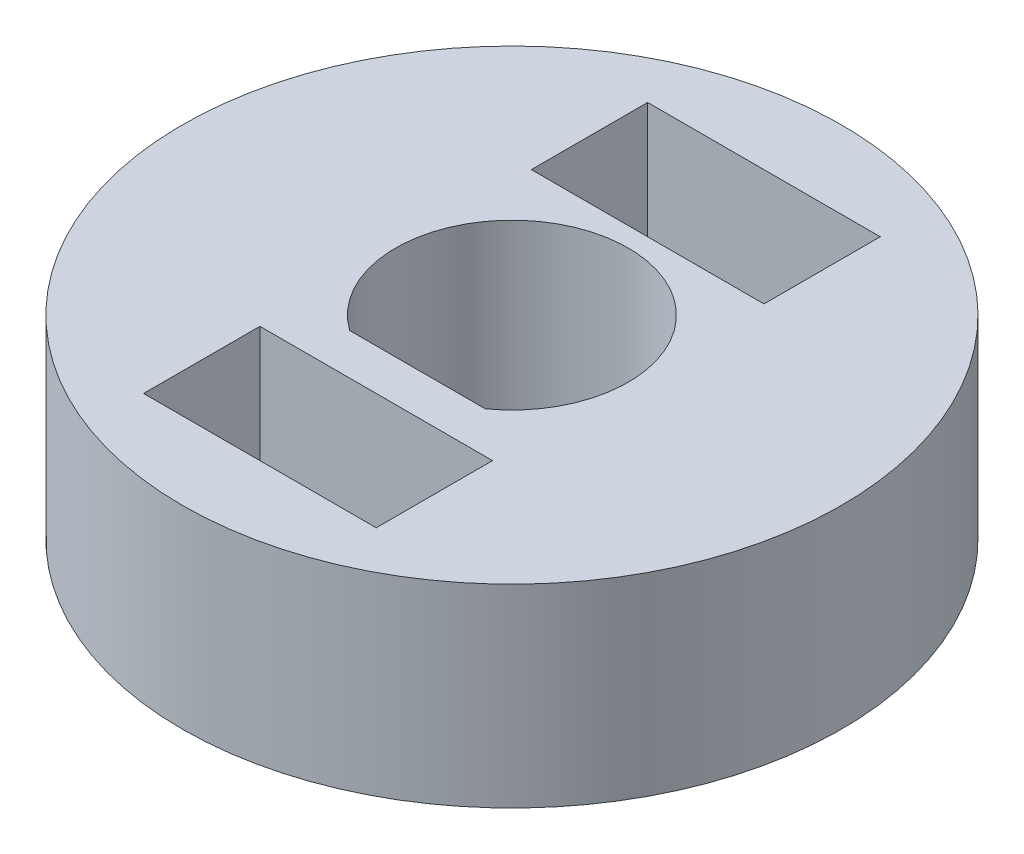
ISO-10303-21;
HEADER;
FILE_DESCRIPTION(('STEP AP214'),'2;1');
FILE_NAME('part.step','',(''),(''),'','','');
FILE_SCHEMA(('AUTOMOTIVE_DESIGN { 1 0 10303 214 1 1 1 1 }'));
ENDSEC;
DATA;
#1=APPLICATION_CONTEXT('core data for automotive mechanical design processes');
#2=APPLICATION_PROTOCOL_DEFINITION('international standard','automotive_design',2000,#1);
#3=PRODUCT_CONTEXT('',#1,'mechanical');
#4=PRODUCT('Part','Part','',(#3));
#5=PRODUCT_RELATED_PRODUCT_CATEGORY('part','',(#4));
#6=PRODUCT_DEFINITION_FORMATION('','',#4);
#7=PRODUCT_DEFINITION_CONTEXT('part definition',#1,'design');
#8=PRODUCT_DEFINITION('design','',#6,#7);
#9=PRODUCT_DEFINITION_SHAPE('','',#8);
#10=(LENGTH_UNIT() NAMED_UNIT(*) SI_UNIT(.MILLI.,.METRE.));
#11=(NAMED_UNIT(*) PLANE_ANGLE_UNIT() SI_UNIT($,.RADIAN.));
#12=(NAMED_UNIT(*) SI_UNIT($,.STERADIAN.) SOLID_ANGLE_UNIT());
#13=UNCERTAINTY_MEASURE_WITH_UNIT(LENGTH_MEASURE(1.E-05),#10,'distance_accuracy_value','');
#14=(GEOMETRIC_REPRESENTATION_CONTEXT(3) GLOBAL_UNCERTAINTY_ASSIGNED_CONTEXT((#13)) GLOBAL_UNIT_ASSIGNED_CONTEXT((#10,
#11,#12)) REPRESENTATION_CONTEXT('',''));
#15=CARTESIAN_POINT('',(0.,0.,0.));
#16=DIRECTION('',(0.,0.,1.));
#17=DIRECTION('',(1.,0.,0.));
#18=AXIS2_PLACEMENT_3D('',#15,#16,#17);
#19=CARTESIAN_POINT('',(0.,5.,0.));
#20=DIRECTION('',(0.,1.,0.));
#21=DIRECTION('',(0.,0.,1.));
#22=AXIS2_PLACEMENT_3D('',#19,#20,#21);
#23=PLANE('',#22);
#24=DIRECTION('',(0.,0.,1.));
#25=VECTOR('',#24,1.);
#26=CARTESIAN_POINT('',(-3.,5.,3.5));
#27=LINE('',#26,#25);
#28=CARTESIAN_POINT('',(-3.,5.,3.5));
#29=VERTEX_POINT('',#28);
#30=CARTESIAN_POINT('',(-3.,5.,6.5));
#31=VERTEX_POINT('',#30);
#32=EDGE_CURVE('E48',#29,#31,#27,.T.);
#33=ORIENTED_EDGE('',*,*,#32,.F.);
#34=DIRECTION('',(-1.,0.,0.));
#35=VECTOR('',#34,1.);
#36=CARTESIAN_POINT('',(-3.,5.,3.5));
#37=LINE('',#36,#35);
#38=CARTESIAN_POINT('',(3.,5.,3.5));
#39=VERTEX_POINT('',#38);
#40=EDGE_CURVE('E131',#39,#29,#37,.T.);
#41=ORIENTED_EDGE('',*,*,#40,.F.);
#42=DIRECTION('',(0.,0.,-1.));
#43=VECTOR('',#42,1.);
#44=CARTESIAN_POINT('',(3.,5.,6.5));
#45=LINE('',#44,#43);
#46=CARTESIAN_POINT('',(3.,5.,6.5));
#47=VERTEX_POINT('',#46);
#48=EDGE_CURVE('E134',#47,#39,#45,.T.);
#49=ORIENTED_EDGE('',*,*,#48,.F.);
#50=DIRECTION('',(1.,0.,0.));
#51=VECTOR('',#50,1.);
#52=CARTESIAN_POINT('',(-3.,5.,6.5));
#53=LINE('',#52,#51);
#54=EDGE_CURVE('E140',#31,#47,#53,.T.);
#55=ORIENTED_EDGE('',*,*,#54,.F.);
#56=EDGE_LOOP('',(#33,#41,#49,#55));
#57=FACE_BOUND('',#56,.T.);
#58=DIRECTION('',(0.,0.,1.));
#59=VECTOR('',#58,1.);
#60=CARTESIAN_POINT('',(-3.,5.,-6.5));
#61=LINE('',#60,#59);
#62=CARTESIAN_POINT('',(-3.,5.,-6.5));
#63=VERTEX_POINT('',#62);
#64=CARTESIAN_POINT('',(-3.,5.,-3.5));
#65=VERTEX_POINT('',#64);
#66=EDGE_CURVE('E56',#63,#65,#61,.T.);
#67=ORIENTED_EDGE('',*,*,#66,.F.);
#68=DIRECTION('',(-1.,0.,0.));
#69=VECTOR('',#68,1.);
#70=CARTESIAN_POINT('',(3.,5.,-6.5));
#71=LINE('',#70,#69);
#72=CARTESIAN_POINT('',(3.,5.,-6.5));
#73=VERTEX_POINT('',#72);
#74=EDGE_CURVE('E155',#73,#63,#71,.T.);
#75=ORIENTED_EDGE('',*,*,#74,.F.);
#76=DIRECTION('',(0.,0.,-1.));
#77=VECTOR('',#76,1.);
#78=CARTESIAN_POINT('',(3.,5.,-3.5));
#79=LINE('',#78,#77);
#80=CARTESIAN_POINT('',(3.,5.,-3.5));
#81=VERTEX_POINT('',#80);
#82=EDGE_CURVE('E169',#81,#73,#79,.T.);
#83=ORIENTED_EDGE('',*,*,#82,.F.);
#84=DIRECTION('',(1.,0.,0.));
#85=VECTOR('',#84,1.);
#86=CARTESIAN_POINT('',(-3.,5.,-3.5));
#87=LINE('',#86,#85);
#88=EDGE_CURVE('E166',#65,#81,#87,.T.);
#89=ORIENTED_EDGE('',*,*,#88,.F.);
#90=EDGE_LOOP('',(#67,#75,#83,#89));
#91=FACE_BOUND('',#90,.T.);
#92=CARTESIAN_POINT('',(0.,5.,0.));
#93=DIRECTION('',(0.,1.,0.));
#94=DIRECTION('',(0.,0.,1.));
#95=AXIS2_PLACEMENT_3D('',#92,#93,#94);
#96=CIRCLE('',#95,8.5);
#97=CARTESIAN_POINT('',(0.,5.,8.5));
#98=VERTEX_POINT('',#97);
#99=EDGE_CURVE('E11',#98,#98,#96,.T.);
#100=ORIENTED_EDGE('',*,*,#99,.T.);
#101=EDGE_LOOP('',(#100));
#102=FACE_BOUND('',#101,.T.);
#103=DIRECTION('',(1.,0.,0.));
#104=VECTOR('',#103,1.);
#105=CARTESIAN_POINT('',(-1.75,5.,2.43669858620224));
#106=LINE('',#105,#104);
#107=CARTESIAN_POINT('',(-1.75,5.,2.43669858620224));
#108=VERTEX_POINT('',#107);
#109=CARTESIAN_POINT('',(1.75,5.,2.43669858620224));
#110=VERTEX_POINT('',#109);
#111=EDGE_CURVE('E183',#108,#110,#106,.T.);
#112=ORIENTED_EDGE('',*,*,#111,.F.);
#113=CARTESIAN_POINT('',(0.,5.,0.));
#114=DIRECTION('',(0.,1.,0.));
#115=DIRECTION('',(0.,0.,1.));
#116=AXIS2_PLACEMENT_3D('',#113,#114,#115);
#117=CIRCLE('',#116,3.);
#118=EDGE_CURVE('E180',#110,#108,#117,.T.);
#119=ORIENTED_EDGE('',*,*,#118,.F.);
#120=EDGE_LOOP('',(#112,#119));
#121=FACE_BOUND('',#120,.T.);
#122=ADVANCED_FACE('F33',(#57,#91,#102,#121),#23,.T.);
#123=CARTESIAN_POINT('',(0.,0.,0.));
#124=DIRECTION('',(0.,1.,0.));
#125=DIRECTION('',(0.,0.,1.));
#126=AXIS2_PLACEMENT_3D('',#123,#124,#125);
#127=PLANE('',#126);
#128=DIRECTION('',(-1.,0.,0.));
#129=VECTOR('',#128,1.);
#130=CARTESIAN_POINT('',(-3.,0.,3.5));
#131=LINE('',#130,#129);
#132=CARTESIAN_POINT('',(3.,0.,3.5));
#133=VERTEX_POINT('',#132);
#134=CARTESIAN_POINT('',(-3.,0.,3.5));
#135=VERTEX_POINT('',#134);
#136=EDGE_CURVE('E118',#133,#135,#131,.T.);
#137=ORIENTED_EDGE('',*,*,#136,.T.);
#138=DIRECTION('',(0.,0.,1.));
#139=VECTOR('',#138,1.);
#140=CARTESIAN_POINT('',(-3.,0.,3.5));
#141=LINE('',#140,#139);
#142=CARTESIAN_POINT('',(-3.,0.,6.5));
#143=VERTEX_POINT('',#142);
#144=EDGE_CURVE('E112',#135,#143,#141,.T.);
#145=ORIENTED_EDGE('',*,*,#144,.T.);
#146=DIRECTION('',(1.,0.,0.));
#147=VECTOR('',#146,1.);
#148=CARTESIAN_POINT('',(-3.,0.,6.5));
#149=LINE('',#148,#147);
#150=CARTESIAN_POINT('',(3.,0.,6.5));
#151=VERTEX_POINT('',#150);
#152=EDGE_CURVE('E122',#143,#151,#149,.T.);
#153=ORIENTED_EDGE('',*,*,#152,.T.);
#154=DIRECTION('',(0.,0.,-1.));
#155=VECTOR('',#154,1.);
#156=CARTESIAN_POINT('',(3.,0.,6.5));
#157=LINE('',#156,#155);
#158=EDGE_CURVE('E126',#151,#133,#157,.T.);
#159=ORIENTED_EDGE('',*,*,#158,.T.);
#160=EDGE_LOOP('',(#137,#145,#153,#159));
#161=FACE_BOUND('',#160,.T.);
#162=DIRECTION('',(-1.,0.,0.));
#163=VECTOR('',#162,1.);
#164=CARTESIAN_POINT('',(3.,0.,-6.5));
#165=LINE('',#164,#163);
#166=CARTESIAN_POINT('',(3.,0.,-6.5));
#167=VERTEX_POINT('',#166);
#168=CARTESIAN_POINT('',(-3.,0.,-6.5));
#169=VERTEX_POINT('',#168);
#170=EDGE_CURVE('E161',#167,#169,#165,.T.);
#171=ORIENTED_EDGE('',*,*,#170,.T.);
#172=DIRECTION('',(0.,0.,1.));
#173=VECTOR('',#172,1.);
#174=CARTESIAN_POINT('',(-3.,0.,-6.5));
#175=LINE('',#174,#173);
#176=CARTESIAN_POINT('',(-3.,0.,-3.5));
#177=VERTEX_POINT('',#176);
#178=EDGE_CURVE('E151',#169,#177,#175,.T.);
#179=ORIENTED_EDGE('',*,*,#178,.T.);
#180=DIRECTION('',(1.,0.,0.));
#181=VECTOR('',#180,1.);
#182=CARTESIAN_POINT('',(-3.,0.,-3.5));
#183=LINE('',#182,#181);
#184=CARTESIAN_POINT('',(3.,0.,-3.5));
#185=VERTEX_POINT('',#184);
#186=EDGE_CURVE('E154',#177,#185,#183,.T.);
#187=ORIENTED_EDGE('',*,*,#186,.T.);
#188=DIRECTION('',(0.,0.,-1.));
#189=VECTOR('',#188,1.);
#190=CARTESIAN_POINT('',(3.,0.,-3.5));
#191=LINE('',#190,#189);
#192=EDGE_CURVE('E158',#185,#167,#191,.T.);
#193=ORIENTED_EDGE('',*,*,#192,.T.);
#194=EDGE_LOOP('',(#171,#179,#187,#193));
#195=FACE_BOUND('',#194,.T.);
#196=CARTESIAN_POINT('',(0.,0.,0.));
#197=DIRECTION('',(0.,1.,0.));
#198=DIRECTION('',(0.,0.,1.));
#199=AXIS2_PLACEMENT_3D('',#196,#197,#198);
#200=CIRCLE('',#199,8.5);
#201=CARTESIAN_POINT('',(0.,0.,8.5));
#202=VERTEX_POINT('',#201);
#203=EDGE_CURVE('E37',#202,#202,#200,.T.);
#204=ORIENTED_EDGE('',*,*,#203,.F.);
#205=EDGE_LOOP('',(#204));
#206=FACE_BOUND('',#205,.T.);
#207=CARTESIAN_POINT('',(0.,0.,0.));
#208=DIRECTION('',(0.,1.,0.));
#209=DIRECTION('',(0.,0.,1.));
#210=AXIS2_PLACEMENT_3D('',#207,#208,#209);
#211=CIRCLE('',#210,3.);
#212=CARTESIAN_POINT('',(1.75,0.,2.43669858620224));
#213=VERTEX_POINT('',#212);
#214=CARTESIAN_POINT('',(-1.75,0.,2.43669858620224));
#215=VERTEX_POINT('',#214);
#216=EDGE_CURVE('E147',#213,#215,#211,.T.);
#217=ORIENTED_EDGE('',*,*,#216,.T.);
#218=DIRECTION('',(1.,0.,0.));
#219=VECTOR('',#218,1.);
#220=CARTESIAN_POINT('',(-1.75,0.,2.43669858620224));
#221=LINE('',#220,#219);
#222=EDGE_CURVE('E184',#215,#213,#221,.T.);
#223=ORIENTED_EDGE('',*,*,#222,.T.);
#224=EDGE_LOOP('',(#217,#223));
#225=FACE_BOUND('',#224,.T.);
#226=ADVANCED_FACE('F128',(#161,#195,#206,#225),#127,.F.);
#227=CARTESIAN_POINT('',(0.,5.,0.));
#228=DIRECTION('',(0.,-1.,0.));
#229=DIRECTION('',(0.,0.,-1.));
#230=AXIS2_PLACEMENT_3D('',#227,#228,#229);
#231=CYLINDRICAL_SURFACE('',#230,8.5);
#232=ORIENTED_EDGE('',*,*,#99,.F.);
#233=EDGE_LOOP('',(#232));
#234=FACE_BOUND('',#233,.T.);
#235=ORIENTED_EDGE('',*,*,#203,.T.);
#236=EDGE_LOOP('',(#235));
#237=FACE_BOUND('',#236,.T.);
#238=ADVANCED_FACE('F35',(#234,#237),#231,.T.);
#239=CARTESIAN_POINT('',(0.,5.,0.));
#240=DIRECTION('',(0.,-1.,0.));
#241=DIRECTION('',(0.,0.,-1.));
#242=AXIS2_PLACEMENT_3D('',#239,#240,#241);
#243=CYLINDRICAL_SURFACE('',#242,3.);
#244=ORIENTED_EDGE('',*,*,#216,.F.);
#245=DIRECTION('',(0.,-1.,0.));
#246=VECTOR('',#245,1.);
#247=CARTESIAN_POINT('',(1.75,5.,2.43669858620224));
#248=LINE('',#247,#246);
#249=EDGE_CURVE('E186',#110,#213,#248,.T.);
#250=ORIENTED_EDGE('',*,*,#249,.F.);
#251=ORIENTED_EDGE('',*,*,#118,.T.);
#252=DIRECTION('',(0.,-1.,0.));
#253=VECTOR('',#252,1.);
#254=CARTESIAN_POINT('',(-1.75,5.,2.43669858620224));
#255=LINE('',#254,#253);
#256=EDGE_CURVE('E193',#108,#215,#255,.T.);
#257=ORIENTED_EDGE('',*,*,#256,.T.);
#258=EDGE_LOOP('',(#244,#250,#251,#257));
#259=FACE_BOUND('',#258,.T.);
#260=ADVANCED_FACE('F203',(#259),#243,.F.);
#261=CARTESIAN_POINT('',(-1.75,5.,2.43669858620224));
#262=DIRECTION('',(0.,0.,-1.));
#263=DIRECTION('',(-1.,0.,0.));
#264=AXIS2_PLACEMENT_3D('',#261,#262,#263);
#265=PLANE('',#264);
#266=ORIENTED_EDGE('',*,*,#222,.F.);
#267=ORIENTED_EDGE('',*,*,#256,.F.);
#268=ORIENTED_EDGE('',*,*,#111,.T.);
#269=ORIENTED_EDGE('',*,*,#249,.T.);
#270=EDGE_LOOP('',(#266,#267,#268,#269));
#271=FACE_BOUND('',#270,.T.);
#272=ADVANCED_FACE('F206',(#271),#265,.T.);
#273=CARTESIAN_POINT('',(-3.,0.,-6.5));
#274=DIRECTION('',(-1.,0.,0.));
#275=DIRECTION('',(0.,0.,1.));
#276=AXIS2_PLACEMENT_3D('',#273,#274,#275);
#277=PLANE('',#276);
#278=ORIENTED_EDGE('',*,*,#66,.T.);
#279=DIRECTION('',(0.,1.,0.));
#280=VECTOR('',#279,1.);
#281=CARTESIAN_POINT('',(-3.,0.,-3.5));
#282=LINE('',#281,#280);
#283=EDGE_CURVE('E164',#177,#65,#282,.T.);
#284=ORIENTED_EDGE('',*,*,#283,.F.);
#285=ORIENTED_EDGE('',*,*,#178,.F.);
#286=DIRECTION('',(0.,1.,0.));
#287=VECTOR('',#286,1.);
#288=CARTESIAN_POINT('',(-3.,0.,-6.5));
#289=LINE('',#288,#287);
#290=EDGE_CURVE('E141',#169,#63,#289,.T.);
#291=ORIENTED_EDGE('',*,*,#290,.T.);
#292=EDGE_LOOP('',(#278,#284,#285,#291));
#293=FACE_BOUND('',#292,.T.);
#294=ADVANCED_FACE('F220',(#293),#277,.F.);
#295=CARTESIAN_POINT('',(3.,0.,-6.5));
#296=DIRECTION('',(0.,0.,-1.));
#297=DIRECTION('',(-1.,0.,0.));
#298=AXIS2_PLACEMENT_3D('',#295,#296,#297);
#299=PLANE('',#298);
#300=ORIENTED_EDGE('',*,*,#74,.T.);
#301=ORIENTED_EDGE('',*,*,#290,.F.);
#302=ORIENTED_EDGE('',*,*,#170,.F.);
#303=DIRECTION('',(0.,1.,0.));
#304=VECTOR('',#303,1.);
#305=CARTESIAN_POINT('',(3.,0.,-6.5));
#306=LINE('',#305,#304);
#307=EDGE_CURVE('E175',#167,#73,#306,.T.);
#308=ORIENTED_EDGE('',*,*,#307,.T.);
#309=EDGE_LOOP('',(#300,#301,#302,#308));
#310=FACE_BOUND('',#309,.T.);
#311=ADVANCED_FACE('F223',(#310),#299,.F.);
#312=CARTESIAN_POINT('',(3.,0.,-3.5));
#313=DIRECTION('',(1.,0.,0.));
#314=DIRECTION('',(0.,0.,-1.));
#315=AXIS2_PLACEMENT_3D('',#312,#313,#314);
#316=PLANE('',#315);
#317=ORIENTED_EDGE('',*,*,#82,.T.);
#318=ORIENTED_EDGE('',*,*,#307,.F.);
#319=ORIENTED_EDGE('',*,*,#192,.F.);
#320=DIRECTION('',(0.,1.,0.));
#321=VECTOR('',#320,1.);
#322=CARTESIAN_POINT('',(3.,0.,-3.5));
#323=LINE('',#322,#321);
#324=EDGE_CURVE('E177',#185,#81,#323,.T.);
#325=ORIENTED_EDGE('',*,*,#324,.T.);
#326=EDGE_LOOP('',(#317,#318,#319,#325));
#327=FACE_BOUND('',#326,.T.);
#328=ADVANCED_FACE('F227',(#327),#316,.F.);
#329=CARTESIAN_POINT('',(-3.,0.,-3.5));
#330=DIRECTION('',(0.,0.,1.));
#331=DIRECTION('',(1.,0.,0.));
#332=AXIS2_PLACEMENT_3D('',#329,#330,#331);
#333=PLANE('',#332);
#334=ORIENTED_EDGE('',*,*,#88,.T.);
#335=ORIENTED_EDGE('',*,*,#324,.F.);
#336=ORIENTED_EDGE('',*,*,#186,.F.);
#337=ORIENTED_EDGE('',*,*,#283,.T.);
#338=EDGE_LOOP('',(#334,#335,#336,#337));
#339=FACE_BOUND('',#338,.T.);
#340=ADVANCED_FACE('F224',(#339),#333,.F.);
#341=CARTESIAN_POINT('',(-3.,0.,3.5));
#342=DIRECTION('',(-1.,0.,0.));
#343=DIRECTION('',(0.,0.,1.));
#344=AXIS2_PLACEMENT_3D('',#341,#342,#343);
#345=PLANE('',#344);
#346=ORIENTED_EDGE('',*,*,#32,.T.);
#347=DIRECTION('',(0.,1.,0.));
#348=VECTOR('',#347,1.);
#349=CARTESIAN_POINT('',(-3.,0.,6.5));
#350=LINE('',#349,#348);
#351=EDGE_CURVE('E108',#143,#31,#350,.T.);
#352=ORIENTED_EDGE('',*,*,#351,.F.);
#353=ORIENTED_EDGE('',*,*,#144,.F.);
#354=DIRECTION('',(0.,1.,0.));
#355=VECTOR('',#354,1.);
#356=CARTESIAN_POINT('',(-3.,0.,3.5));
#357=LINE('',#356,#355);
#358=EDGE_CURVE('E145',#135,#29,#357,.T.);
#359=ORIENTED_EDGE('',*,*,#358,.T.);
#360=EDGE_LOOP('',(#346,#352,#353,#359));
#361=FACE_BOUND('',#360,.T.);
#362=ADVANCED_FACE('F110',(#361),#345,.F.);
#363=CARTESIAN_POINT('',(-3.,0.,3.5));
#364=DIRECTION('',(0.,0.,-1.));
#365=DIRECTION('',(-1.,0.,0.));
#366=AXIS2_PLACEMENT_3D('',#363,#364,#365);
#367=PLANE('',#366);
#368=ORIENTED_EDGE('',*,*,#40,.T.);
#369=ORIENTED_EDGE('',*,*,#358,.F.);
#370=ORIENTED_EDGE('',*,*,#136,.F.);
#371=DIRECTION('',(0.,1.,0.));
#372=VECTOR('',#371,1.);
#373=CARTESIAN_POINT('',(3.,0.,3.5));
#374=LINE('',#373,#372);
#375=EDGE_CURVE('E148',#133,#39,#374,.T.);
#376=ORIENTED_EDGE('',*,*,#375,.T.);
#377=EDGE_LOOP('',(#368,#369,#370,#376));
#378=FACE_BOUND('',#377,.T.);
#379=ADVANCED_FACE('F237',(#378),#367,.F.);
#380=CARTESIAN_POINT('',(3.,0.,6.5));
#381=DIRECTION('',(1.,0.,0.));
#382=DIRECTION('',(0.,0.,-1.));
#383=AXIS2_PLACEMENT_3D('',#380,#381,#382);
#384=PLANE('',#383);
#385=ORIENTED_EDGE('',*,*,#48,.T.);
#386=ORIENTED_EDGE('',*,*,#375,.F.);
#387=ORIENTED_EDGE('',*,*,#158,.F.);
#388=DIRECTION('',(0.,1.,0.));
#389=VECTOR('',#388,1.);
#390=CARTESIAN_POINT('',(3.,0.,6.5));
#391=LINE('',#390,#389);
#392=EDGE_CURVE('E117',#151,#47,#391,.T.);
#393=ORIENTED_EDGE('',*,*,#392,.T.);
#394=EDGE_LOOP('',(#385,#386,#387,#393));
#395=FACE_BOUND('',#394,.T.);
#396=ADVANCED_FACE('F240',(#395),#384,.F.);
#397=CARTESIAN_POINT('',(-3.,0.,6.5));
#398=DIRECTION('',(0.,0.,1.));
#399=DIRECTION('',(1.,0.,0.));
#400=AXIS2_PLACEMENT_3D('',#397,#398,#399);
#401=PLANE('',#400);
#402=ORIENTED_EDGE('',*,*,#54,.T.);
#403=ORIENTED_EDGE('',*,*,#392,.F.);
#404=ORIENTED_EDGE('',*,*,#152,.F.);
#405=ORIENTED_EDGE('',*,*,#351,.T.);
#406=EDGE_LOOP('',(#402,#403,#404,#405));
#407=FACE_BOUND('',#406,.T.);
#408=ADVANCED_FACE('F123',(#407),#401,.F.);
#409=CLOSED_SHELL('',(#122,#226,#238,#260,#272,#294,#311,#328,#340,#362,#379,#396,#408));
#410=MANIFOLD_SOLID_BREP('B2',#409);
#411=ADVANCED_BREP_SHAPE_REPRESENTATION('',(#18,#410),#14);
#412=SHAPE_DEFINITION_REPRESENTATION(#9,#411);
ENDSEC;
END-ISO-10303-21;
